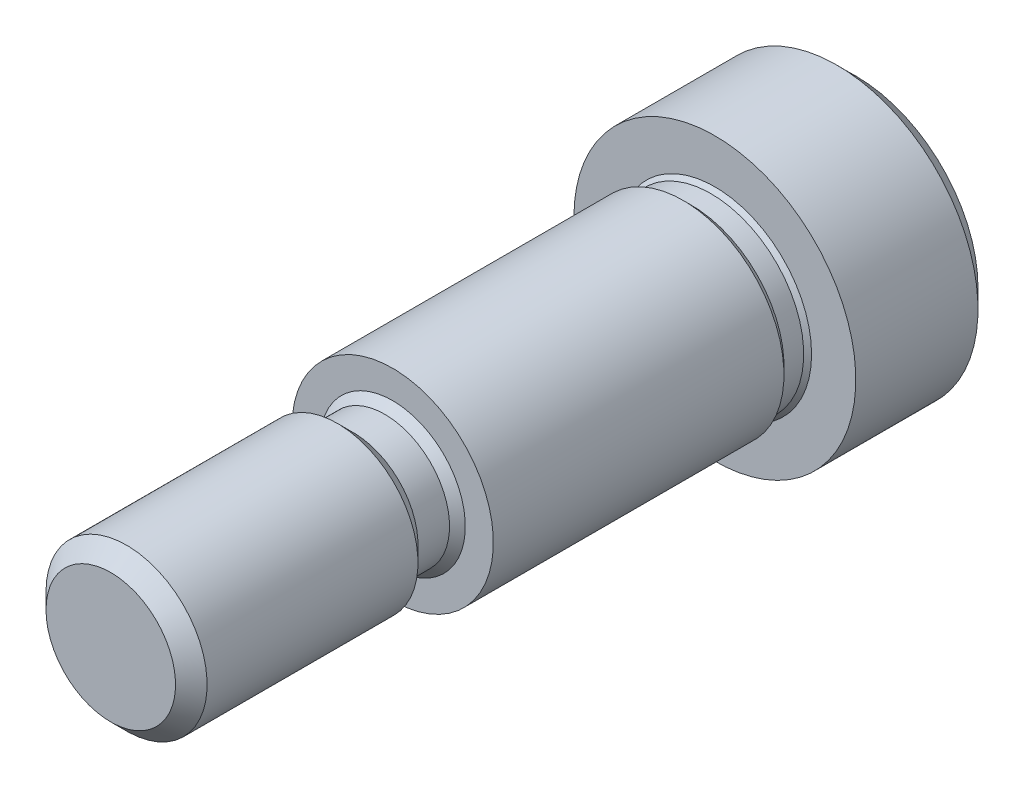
from build123d import *

# Parameters (mm, degrees)
CUT_EXTRUDE1_DEPTH = 3.705013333


with BuildPart() as part:
    # Logo3_bib1 → Revolve1 (revolve)
    with BuildSketch(Plane(origin=(0, 0, 0), x_dir=(-1, 0, 0), z_dir=(0, -1, 0))):
        Polygon((3.96875, 0), (2.86385, 0), (2.5527, -0.31115), (2.5527, -1.55575), (3.175, -2.17805), (3.175, -10.4902), (2.5527, -11.1125), (0, -11.1125), (0, 18.25752), (4.815416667, 18.25752), (5.55625, 17.516686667), (5.55625, 12.7), (3.813175, 12.7), (3.6576, 12.544425), (3.6576, 11.76655), (3.96875, 11.4554), align=None)
    revolve(axis=Axis((0, 0, -62.352722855), (0, 0, 1)))

    # Logo3_bib2 → Cut-Extrude1 (cut)
    with BuildSketch(Plane(origin=(0, 0, -18.25752), x_dir=(1, 0, 0), z_dir=(0, 0, -1))):
        Polygon((2.292092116, 0), (1.146046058, 1.98501), (-1.146046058, 1.98501), (-2.292092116, 0), (-1.146046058, -1.98501), (1.146046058, -1.98501), align=None)
    extrude(amount=-CUT_EXTRUDE1_DEPTH, mode=Mode.SUBTRACT)


solid = part.part
